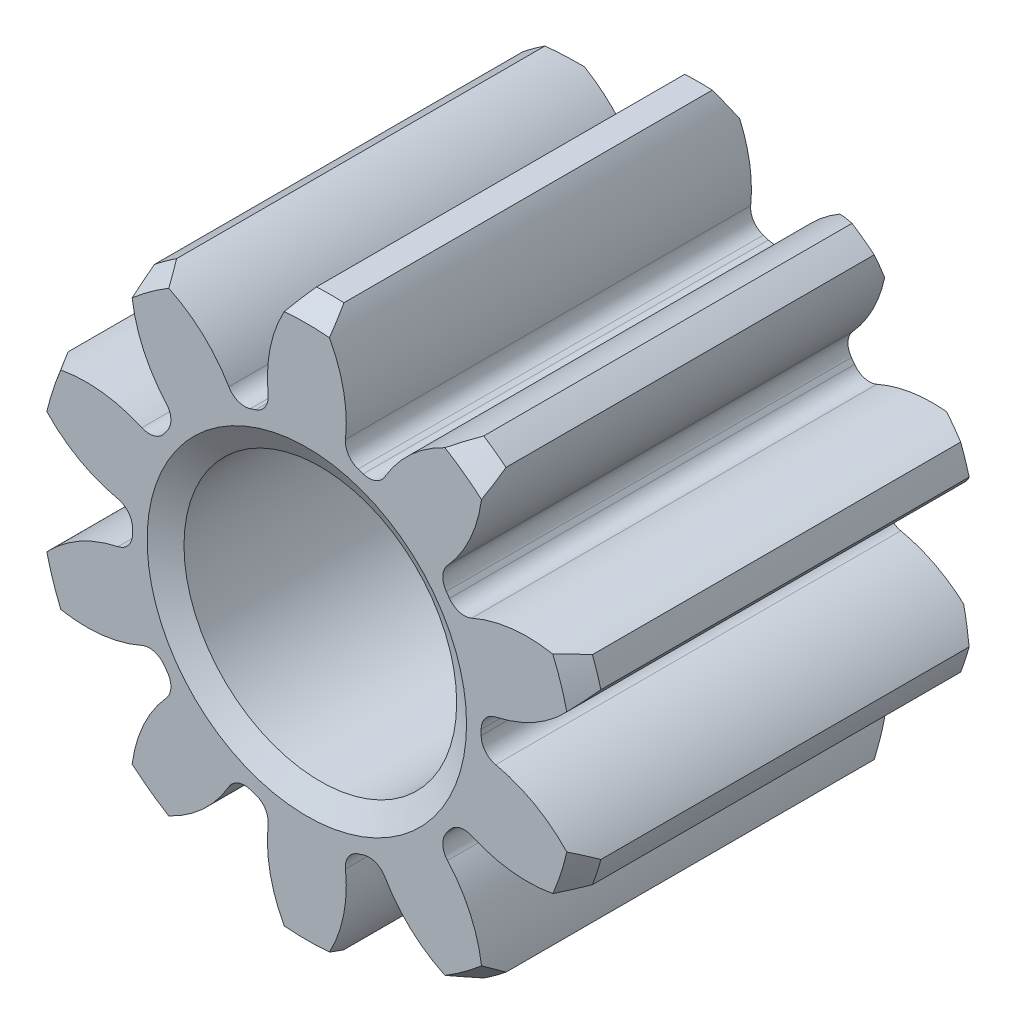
from build123d import *
from OCP.BRepFilletAPI import BRepFilletAPI_MakeChamfer

# Parameters (mm, degrees)
BOSS_EXTRUDE1_DEPTH      = 1.3
BOSS_EXTRUDE1_DEPTH_BACK = 1.3
SKETCH3_R                = 1.8
SKETCH5_W                = 2.6
SKETCH5_H                = 0.875
CHAMFER1_SIZE            = 0.15
CHAMFER1_SIZE2           = 0.08660254
CUT_EXTRUDE1_DEPTH       = 3.858321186
FILLET1_R                = 0.117809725
CIRPATTERN1_COUNT        = 10
FILLET1_OF_CIRPATTERN1_R = 0.117809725


with BuildPart() as part:
    # Sketch3 → Boss-Extrude1 (new, two sides: drawn at the far end of the back side and taken through both)
    with BuildSketch(Plane.XY.offset(-BOSS_EXTRUDE1_DEPTH_BACK)):
        Circle(SKETCH3_R)
    extrude(amount=BOSS_EXTRUDE1_DEPTH + BOSS_EXTRUDE1_DEPTH_BACK)

    # Sketch5 → Cut-Revolve1 (revolve, cut)
    with BuildSketch(Plane(origin=(0, 0, 0), x_dir=(0, 0, -1), z_dir=(1, 0, 0)), mode=Mode.PRIVATE) as cut_revolve1_sk:
        with Locations((0, 0.4375)):
            Rectangle(SKETCH5_W, SKETCH5_H)
    revolve(cut_revolve1_sk.sketch.rotate(Axis((0, 0, 5.997700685), (0, 0, -1)), 90), axis=Axis((0, 0, 5.997700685), (0, 0, -1)), mode=Mode.SUBTRACT)

    # Chamfer1: one chamfer whose edges measure the first distance from different faces: ONE call of the kernel's chamfer builder (chamfer() names one face for all edges)
    chamfer1_edges_1 = [part.edges().sort_by_distance(p)[0] for p in [
        (-1.8, 0, -1.3),
    ]]
    chamfer1_side_1 = [part.faces().sort_by_distance(p)[0] for p in [
        (-1.749088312, 0, -1.3),
    ]]
    chamfer1_edges_2 = [part.edges().sort_by_distance(p)[0] for p in [
        (-1.8, 0, 1.3),
    ]]
    chamfer1_side_2 = [part.faces().sort_by_distance(p)[0] for p in [
        (-1.8, 0, 0.65),
    ]]
    chamfer1_edges_3 = [part.edges().sort_by_distance(p)[0] for p in [
        (-0.875, 0, 1.3),
    ]]
    chamfer1_side_3 = [part.faces().sort_by_distance(p)[0] for p in [
        (-1.749088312, 0, 1.3),
    ]]
    chamfer1_edges_4 = [part.edges().sort_by_distance(p)[0] for p in [
        (-0.875, 0, -1.3),
    ]]
    chamfer1_side_4 = [part.faces().sort_by_distance(p)[0] for p in [
        (-0.875, 0, 0),
    ]]
    chamfer1 = BRepFilletAPI_MakeChamfer(part.part.solid().wrapped)
    for e in chamfer1_edges_1:
        chamfer1.Add(CHAMFER1_SIZE, CHAMFER1_SIZE2, e.wrapped, chamfer1_side_1[0].wrapped)  # the first distance lies on this face
    for e in chamfer1_edges_2:
        chamfer1.Add(CHAMFER1_SIZE, CHAMFER1_SIZE2, e.wrapped, chamfer1_side_2[0].wrapped)  # the first distance lies on this face
    for e in chamfer1_edges_3:
        chamfer1.Add(CHAMFER1_SIZE, CHAMFER1_SIZE2, e.wrapped, chamfer1_side_3[0].wrapped)  # the first distance lies on this face
    for e in chamfer1_edges_4:
        chamfer1.Add(CHAMFER1_SIZE, CHAMFER1_SIZE2, e.wrapped, chamfer1_side_4[0].wrapped)  # the first distance lies on this face
    add(Compound.cast(chamfer1.Shape()), mode=Mode.REPLACE)

    # Sketch4 → Cut-Extrude1 (cut, symmetric)
    with BuildSketch(Plane.XY):
        with BuildLine():
            Line((1.118814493, -0.117809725), (1.118814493, 0.117809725))
            ThreePointArc((1.118814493, 0.117809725), (1.465338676, 0.229467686), (1.737080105, 0.471754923))
            ThreePointArc((1.737080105, 0.471754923), (1.8, 0), (1.737080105, -0.471754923))
            ThreePointArc((1.737080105, -0.471754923), (1.465338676, -0.229467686), (1.118814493, -0.117809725))
        make_face()
    cut_extrude1 = extrude(amount=CUT_EXTRUDE1_DEPTH, both=True, mode=Mode.SUBTRACT)

    # Fillet1
    fillet1_edges = [part.edges().sort_by_distance(p)[0] for p in [
        (1.118814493, 0.117809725, 0),
        (1.118814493, -0.117809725, 0),
    ]]
    fillet(fillet1_edges, radius=FILLET1_R)

    # CirPattern1: Cut-Extrude1 ×10 about axis
    cirpattern1_axis = Axis((0, 0, 0), (0, 0, 1))
    for i in range(1, CIRPATTERN1_COUNT):
        add(cut_extrude1.rotate(cirpattern1_axis, i * 360 / CIRPATTERN1_COUNT), mode=Mode.SUBTRACT)

    # Fillet1 of CirPattern1
    fillet1_of_cirpattern1_edges = [part.edges().sort_by_distance(p)[0] for p in [
        (0.835893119, 0.752932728, 0),
        (0.974386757, 0.56231259, 0),
        (0.233688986, 1.100461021, 0),
        (0.457776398, 1.027650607, 0),
        (-0.457776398, 1.027650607, 0),
        (-0.233688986, 1.100461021, 0),
        (-0.974386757, 0.56231259, 0),
        (-0.835893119, 0.752932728, 0),
        (-1.118814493, -0.117809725, 0),
        (-1.118814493, 0.117809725, 0),
        (-0.835893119, -0.752932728, 0),
        (-0.974386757, -0.56231259, 0),
        (-0.233688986, -1.100461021, 0),
        (-0.457776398, -1.027650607, 0),
        (0.457776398, -1.027650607, 0),
        (0.233688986, -1.100461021, 0),
        (0.974386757, -0.56231259, 0),
        (0.835893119, -0.752932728, 0),
    ]]
    fillet(fillet1_of_cirpattern1_edges, radius=FILLET1_OF_CIRPATTERN1_R)


solid = part.part
